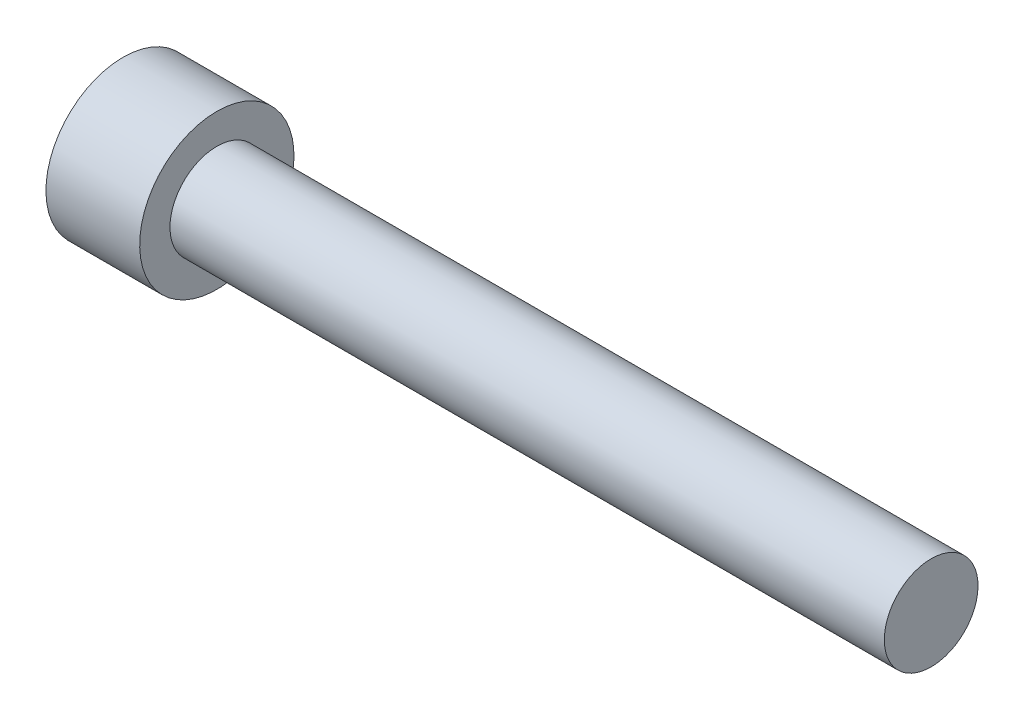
ISO-10303-21;
HEADER;
FILE_DESCRIPTION(('STEP AP214'),'2;1');
FILE_NAME('part.step','',(''),(''),'','','');
FILE_SCHEMA(('AUTOMOTIVE_DESIGN { 1 0 10303 214 1 1 1 1 }'));
ENDSEC;
DATA;
#1=APPLICATION_CONTEXT('core data for automotive mechanical design processes');
#2=APPLICATION_PROTOCOL_DEFINITION('international standard','automotive_design',2000,#1);
#3=PRODUCT_CONTEXT('',#1,'mechanical');
#4=PRODUCT('Part','Part','',(#3));
#5=PRODUCT_RELATED_PRODUCT_CATEGORY('part','',(#4));
#6=PRODUCT_DEFINITION_FORMATION('','',#4);
#7=PRODUCT_DEFINITION_CONTEXT('part definition',#1,'design');
#8=PRODUCT_DEFINITION('design','',#6,#7);
#9=PRODUCT_DEFINITION_SHAPE('','',#8);
#10=(LENGTH_UNIT() NAMED_UNIT(*) SI_UNIT(.MILLI.,.METRE.));
#11=(NAMED_UNIT(*) PLANE_ANGLE_UNIT() SI_UNIT($,.RADIAN.));
#12=(NAMED_UNIT(*) SI_UNIT($,.STERADIAN.) SOLID_ANGLE_UNIT());
#13=UNCERTAINTY_MEASURE_WITH_UNIT(LENGTH_MEASURE(1.E-05),#10,'distance_accuracy_value','');
#14=(GEOMETRIC_REPRESENTATION_CONTEXT(3) GLOBAL_UNCERTAINTY_ASSIGNED_CONTEXT((#13)) GLOBAL_UNIT_ASSIGNED_CONTEXT((#10,
#11,#12)) REPRESENTATION_CONTEXT('',''));
#15=CARTESIAN_POINT('',(0.,0.,0.));
#16=DIRECTION('',(0.,0.,1.));
#17=DIRECTION('',(1.,0.,0.));
#18=AXIS2_PLACEMENT_3D('',#15,#16,#17);
#19=CARTESIAN_POINT('',(35.9156,0.,0.));
#20=DIRECTION('',(1.,0.,0.));
#21=DIRECTION('',(0.,1.,0.));
#22=AXIS2_PLACEMENT_3D('',#19,#20,#21);
#23=PLANE('',#22);
#24=CARTESIAN_POINT('',(35.9156,0.,0.));
#25=DIRECTION('',(1.,0.,0.));
#26=DIRECTION('',(0.,1.,0.));
#27=AXIS2_PLACEMENT_3D('',#24,#25,#26);
#28=CIRCLE('',#27,2.0828);
#29=CARTESIAN_POINT('',(35.9156,2.0828,0.));
#30=VERTEX_POINT('',#29);
#31=EDGE_CURVE('E11',#30,#30,#28,.T.);
#32=ORIENTED_EDGE('',*,*,#31,.T.);
#33=EDGE_LOOP('',(#32));
#34=FACE_BOUND('',#33,.T.);
#35=ADVANCED_FACE('F381',(#34),#23,.T.);
#36=CARTESIAN_POINT('',(35.9156,0.,0.));
#37=DIRECTION('',(1.,0.,0.));
#38=DIRECTION('',(0.,1.,0.));
#39=AXIS2_PLACEMENT_3D('',#36,#37,#38);
#40=CYLINDRICAL_SURFACE('',#39,2.0828);
#41=CARTESIAN_POINT('',(4.1656,0.,0.));
#42=DIRECTION('',(1.,0.,0.));
#43=DIRECTION('',(0.,1.,0.));
#44=AXIS2_PLACEMENT_3D('',#41,#42,#43);
#45=CIRCLE('',#44,2.0828);
#46=CARTESIAN_POINT('',(4.1656,2.0828,0.));
#47=VERTEX_POINT('',#46);
#48=EDGE_CURVE('E388',#47,#47,#45,.T.);
#49=ORIENTED_EDGE('',*,*,#48,.T.);
#50=EDGE_LOOP('',(#49));
#51=FACE_BOUND('',#50,.T.);
#52=ORIENTED_EDGE('',*,*,#31,.F.);
#53=EDGE_LOOP('',(#52));
#54=FACE_BOUND('',#53,.T.);
#55=ADVANCED_FACE('F497',(#51,#54),#40,.T.);
#56=CARTESIAN_POINT('',(4.1656,3.429,0.));
#57=DIRECTION('',(1.,0.,0.));
#58=DIRECTION('',(0.,1.,0.));
#59=AXIS2_PLACEMENT_3D('',#56,#57,#58);
#60=PLANE('',#59);
#61=CARTESIAN_POINT('',(4.1656,0.,0.));
#62=DIRECTION('',(1.,0.,0.));
#63=DIRECTION('',(0.,1.,0.));
#64=AXIS2_PLACEMENT_3D('',#61,#62,#63);
#65=CIRCLE('',#64,3.429);
#66=CARTESIAN_POINT('',(4.1656,3.429,0.));
#67=VERTEX_POINT('',#66);
#68=EDGE_CURVE('E492',#67,#67,#65,.T.);
#69=ORIENTED_EDGE('',*,*,#68,.T.);
#70=EDGE_LOOP('',(#69));
#71=FACE_BOUND('',#70,.T.);
#72=ORIENTED_EDGE('',*,*,#48,.F.);
#73=EDGE_LOOP('',(#72));
#74=FACE_BOUND('',#73,.T.);
#75=ADVANCED_FACE('F500',(#71,#74),#60,.T.);
#76=CARTESIAN_POINT('',(35.9156,0.,0.));
#77=DIRECTION('',(1.,0.,0.));
#78=DIRECTION('',(0.,1.,0.));
#79=AXIS2_PLACEMENT_3D('',#76,#77,#78);
#80=CYLINDRICAL_SURFACE('',#79,3.429);
#81=CARTESIAN_POINT('',(0.,0.,0.));
#82=DIRECTION('',(1.,0.,0.));
#83=DIRECTION('',(0.,1.,0.));
#84=AXIS2_PLACEMENT_3D('',#81,#82,#83);
#85=CIRCLE('',#84,3.429);
#86=CARTESIAN_POINT('',(0.,3.429,0.));
#87=VERTEX_POINT('',#86);
#88=EDGE_CURVE('E483',#87,#87,#85,.T.);
#89=ORIENTED_EDGE('',*,*,#88,.T.);
#90=EDGE_LOOP('',(#89));
#91=FACE_BOUND('',#90,.T.);
#92=ORIENTED_EDGE('',*,*,#68,.F.);
#93=EDGE_LOOP('',(#92));
#94=FACE_BOUND('',#93,.T.);
#95=ADVANCED_FACE('F502',(#91,#94),#80,.T.);
#96=CARTESIAN_POINT('',(0.,0.,0.));
#97=DIRECTION('',(-1.,0.,0.));
#98=DIRECTION('',(0.,-1.,0.));
#99=AXIS2_PLACEMENT_3D('',#96,#97,#98);
#100=PLANE('',#99);
#101=DIRECTION('',(0.,0.866025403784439,0.5));
#102=VECTOR('',#101,1.);
#103=CARTESIAN_POINT('',(0.,-1.7859375,1.03111149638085));
#104=LINE('',#103,#102);
#105=CARTESIAN_POINT('',(0.,-1.7859375,1.03111149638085));
#106=VERTEX_POINT('',#105);
#107=CARTESIAN_POINT('',(0.,0.,2.06222299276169));
#108=VERTEX_POINT('',#107);
#109=EDGE_CURVE('E395',#106,#108,#104,.T.);
#110=ORIENTED_EDGE('',*,*,#109,.F.);
#111=DIRECTION('',(0.,0.,1.));
#112=VECTOR('',#111,1.);
#113=CARTESIAN_POINT('',(0.,-1.7859375,-1.03111149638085));
#114=LINE('',#113,#112);
#115=CARTESIAN_POINT('',(0.,-1.7859375,-1.03111149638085));
#116=VERTEX_POINT('',#115);
#117=EDGE_CURVE('E465',#116,#106,#114,.T.);
#118=ORIENTED_EDGE('',*,*,#117,.F.);
#119=DIRECTION('',(0.,-0.866025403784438,0.5));
#120=VECTOR('',#119,1.);
#121=CARTESIAN_POINT('',(0.,0.,-2.06222299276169));
#122=LINE('',#121,#120);
#123=CARTESIAN_POINT('',(0.,0.,-2.06222299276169));
#124=VERTEX_POINT('',#123);
#125=EDGE_CURVE('E459',#124,#116,#122,.T.);
#126=ORIENTED_EDGE('',*,*,#125,.F.);
#127=DIRECTION('',(0.,-0.866025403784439,-0.499999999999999));
#128=VECTOR('',#127,1.);
#129=CARTESIAN_POINT('',(0.,1.7859375,-1.03111149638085));
#130=LINE('',#129,#128);
#131=CARTESIAN_POINT('',(0.,1.7859375,-1.03111149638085));
#132=VERTEX_POINT('',#131);
#133=EDGE_CURVE('E457',#132,#124,#130,.T.);
#134=ORIENTED_EDGE('',*,*,#133,.F.);
#135=DIRECTION('',(0.,0.,-1.));
#136=VECTOR('',#135,1.);
#137=CARTESIAN_POINT('',(0.,1.7859375,1.03111149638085));
#138=LINE('',#137,#136);
#139=CARTESIAN_POINT('',(0.,1.7859375,1.03111149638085));
#140=VERTEX_POINT('',#139);
#141=EDGE_CURVE('E438',#140,#132,#138,.T.);
#142=ORIENTED_EDGE('',*,*,#141,.F.);
#143=DIRECTION('',(0.,0.866025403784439,-0.5));
#144=VECTOR('',#143,1.);
#145=CARTESIAN_POINT('',(0.,0.,2.06222299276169));
#146=LINE('',#145,#144);
#147=EDGE_CURVE('E449',#108,#140,#146,.T.);
#148=ORIENTED_EDGE('',*,*,#147,.F.);
#149=EDGE_LOOP('',(#110,#118,#126,#134,#142,#148));
#150=FACE_BOUND('',#149,.T.);
#151=ORIENTED_EDGE('',*,*,#88,.F.);
#152=EDGE_LOOP('',(#151));
#153=FACE_BOUND('',#152,.T.);
#154=ADVANCED_FACE('F453',(#150,#153),#100,.T.);
#155=CARTESIAN_POINT('',(4.826,-1.7859375,1.03111149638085));
#156=DIRECTION('',(0.,-0.5,0.866025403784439));
#157=DIRECTION('',(0.,-0.866025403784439,-0.5));
#158=AXIS2_PLACEMENT_3D('',#155,#156,#157);
#159=PLANE('',#158);
#160=ORIENTED_EDGE('',*,*,#109,.T.);
#161=DIRECTION('',(-1.,0.,0.));
#162=VECTOR('',#161,1.);
#163=CARTESIAN_POINT('',(4.826,0.,2.06222299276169));
#164=LINE('',#163,#162);
#165=CARTESIAN_POINT('',(4.826,0.,2.06222299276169));
#166=VERTEX_POINT('',#165);
#167=EDGE_CURVE('E446',#166,#108,#164,.T.);
#168=ORIENTED_EDGE('',*,*,#167,.F.);
#169=DIRECTION('',(0.,0.866025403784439,0.5));
#170=VECTOR('',#169,1.);
#171=CARTESIAN_POINT('',(4.826,-1.7859375,1.03111149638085));
#172=LINE('',#171,#170);
#173=CARTESIAN_POINT('',(4.826,-1.7859375,1.03111149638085));
#174=VERTEX_POINT('',#173);
#175=EDGE_CURVE('E467',#174,#166,#172,.T.);
#176=ORIENTED_EDGE('',*,*,#175,.F.);
#177=DIRECTION('',(-1.,0.,0.));
#178=VECTOR('',#177,1.);
#179=CARTESIAN_POINT('',(4.826,-1.7859375,1.03111149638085));
#180=LINE('',#179,#178);
#181=EDGE_CURVE('E402',#174,#106,#180,.T.);
#182=ORIENTED_EDGE('',*,*,#181,.T.);
#183=EDGE_LOOP('',(#160,#168,#176,#182));
#184=FACE_BOUND('',#183,.T.);
#185=ADVANCED_FACE('F533',(#184),#159,.F.);
#186=CARTESIAN_POINT('',(4.826,-1.7859375,-1.03111149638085));
#187=DIRECTION('',(0.,-1.,0.));
#188=DIRECTION('',(1.,0.,0.));
#189=AXIS2_PLACEMENT_3D('',#186,#187,#188);
#190=PLANE('',#189);
#191=ORIENTED_EDGE('',*,*,#117,.T.);
#192=ORIENTED_EDGE('',*,*,#181,.F.);
#193=DIRECTION('',(0.,0.,1.));
#194=VECTOR('',#193,1.);
#195=CARTESIAN_POINT('',(4.826,-1.7859375,-1.03111149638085));
#196=LINE('',#195,#194);
#197=CARTESIAN_POINT('',(4.826,-1.7859375,-1.03111149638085));
#198=VERTEX_POINT('',#197);
#199=EDGE_CURVE('E479',#198,#174,#196,.T.);
#200=ORIENTED_EDGE('',*,*,#199,.F.);
#201=DIRECTION('',(-1.,0.,0.));
#202=VECTOR('',#201,1.);
#203=CARTESIAN_POINT('',(4.826,-1.7859375,-1.03111149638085));
#204=LINE('',#203,#202);
#205=EDGE_CURVE('E484',#198,#116,#204,.T.);
#206=ORIENTED_EDGE('',*,*,#205,.T.);
#207=EDGE_LOOP('',(#191,#192,#200,#206));
#208=FACE_BOUND('',#207,.T.);
#209=ADVANCED_FACE('F540',(#208),#190,.F.);
#210=CARTESIAN_POINT('',(4.826,0.,-2.06222299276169));
#211=DIRECTION('',(0.,-0.5,-0.866025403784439));
#212=DIRECTION('',(0.,0.866025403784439,-0.5));
#213=AXIS2_PLACEMENT_3D('',#210,#211,#212);
#214=PLANE('',#213);
#215=ORIENTED_EDGE('',*,*,#125,.T.);
#216=ORIENTED_EDGE('',*,*,#205,.F.);
#217=DIRECTION('',(0.,-0.866025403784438,0.5));
#218=VECTOR('',#217,1.);
#219=CARTESIAN_POINT('',(4.826,0.,-2.06222299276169));
#220=LINE('',#219,#218);
#221=CARTESIAN_POINT('',(4.826,0.,-2.06222299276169));
#222=VERTEX_POINT('',#221);
#223=EDGE_CURVE('E476',#222,#198,#220,.T.);
#224=ORIENTED_EDGE('',*,*,#223,.F.);
#225=DIRECTION('',(-1.,0.,0.));
#226=VECTOR('',#225,1.);
#227=CARTESIAN_POINT('',(4.826,0.,-2.06222299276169));
#228=LINE('',#227,#226);
#229=EDGE_CURVE('E486',#222,#124,#228,.T.);
#230=ORIENTED_EDGE('',*,*,#229,.T.);
#231=EDGE_LOOP('',(#215,#216,#224,#230));
#232=FACE_BOUND('',#231,.T.);
#233=ADVANCED_FACE('F547',(#232),#214,.F.);
#234=CARTESIAN_POINT('',(4.826,1.7859375,-1.03111149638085));
#235=DIRECTION('',(0.,0.499999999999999,-0.866025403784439));
#236=DIRECTION('',(0.,0.866025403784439,0.499999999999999));
#237=AXIS2_PLACEMENT_3D('',#234,#235,#236);
#238=PLANE('',#237);
#239=ORIENTED_EDGE('',*,*,#133,.T.);
#240=ORIENTED_EDGE('',*,*,#229,.F.);
#241=DIRECTION('',(0.,-0.866025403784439,-0.499999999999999));
#242=VECTOR('',#241,1.);
#243=CARTESIAN_POINT('',(4.826,1.7859375,-1.03111149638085));
#244=LINE('',#243,#242);
#245=CARTESIAN_POINT('',(4.826,1.7859375,-1.03111149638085));
#246=VERTEX_POINT('',#245);
#247=EDGE_CURVE('E473',#246,#222,#244,.T.);
#248=ORIENTED_EDGE('',*,*,#247,.F.);
#249=DIRECTION('',(-1.,0.,0.));
#250=VECTOR('',#249,1.);
#251=CARTESIAN_POINT('',(4.826,1.7859375,-1.03111149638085));
#252=LINE('',#251,#250);
#253=EDGE_CURVE('E445',#246,#132,#252,.T.);
#254=ORIENTED_EDGE('',*,*,#253,.T.);
#255=EDGE_LOOP('',(#239,#240,#248,#254));
#256=FACE_BOUND('',#255,.T.);
#257=ADVANCED_FACE('F554',(#256),#238,.F.);
#258=CARTESIAN_POINT('',(4.826,1.7859375,1.03111149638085));
#259=DIRECTION('',(0.,1.,0.));
#260=DIRECTION('',(-1.,0.,0.));
#261=AXIS2_PLACEMENT_3D('',#258,#259,#260);
#262=PLANE('',#261);
#263=ORIENTED_EDGE('',*,*,#141,.T.);
#264=ORIENTED_EDGE('',*,*,#253,.F.);
#265=DIRECTION('',(0.,0.,-1.));
#266=VECTOR('',#265,1.);
#267=CARTESIAN_POINT('',(4.826,1.7859375,1.03111149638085));
#268=LINE('',#267,#266);
#269=CARTESIAN_POINT('',(4.826,1.7859375,1.03111149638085));
#270=VERTEX_POINT('',#269);
#271=EDGE_CURVE('E441',#270,#246,#268,.T.);
#272=ORIENTED_EDGE('',*,*,#271,.F.);
#273=DIRECTION('',(-1.,0.,0.));
#274=VECTOR('',#273,1.);
#275=CARTESIAN_POINT('',(4.826,1.7859375,1.03111149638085));
#276=LINE('',#275,#274);
#277=EDGE_CURVE('E434',#270,#140,#276,.T.);
#278=ORIENTED_EDGE('',*,*,#277,.T.);
#279=EDGE_LOOP('',(#263,#264,#272,#278));
#280=FACE_BOUND('',#279,.T.);
#281=ADVANCED_FACE('F436',(#280),#262,.F.);
#282=CARTESIAN_POINT('',(4.826,0.,2.06222299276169));
#283=DIRECTION('',(0.,0.5,0.866025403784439));
#284=DIRECTION('',(0.,-0.866025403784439,0.5));
#285=AXIS2_PLACEMENT_3D('',#282,#283,#284);
#286=PLANE('',#285);
#287=ORIENTED_EDGE('',*,*,#147,.T.);
#288=ORIENTED_EDGE('',*,*,#277,.F.);
#289=DIRECTION('',(0.,0.866025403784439,-0.5));
#290=VECTOR('',#289,1.);
#291=CARTESIAN_POINT('',(4.826,0.,2.06222299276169));
#292=LINE('',#291,#290);
#293=EDGE_CURVE('E470',#166,#270,#292,.T.);
#294=ORIENTED_EDGE('',*,*,#293,.F.);
#295=ORIENTED_EDGE('',*,*,#167,.T.);
#296=EDGE_LOOP('',(#287,#288,#294,#295));
#297=FACE_BOUND('',#296,.T.);
#298=ADVANCED_FACE('F450',(#297),#286,.F.);
#299=CARTESIAN_POINT('',(4.826,1.7859375,3.09333448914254));
#300=DIRECTION('',(-1.,0.,0.));
#301=DIRECTION('',(0.,-1.,0.));
#302=AXIS2_PLACEMENT_3D('',#299,#300,#301);
#303=PLANE('',#302);
#304=ORIENTED_EDGE('',*,*,#175,.T.);
#305=ORIENTED_EDGE('',*,*,#293,.T.);
#306=ORIENTED_EDGE('',*,*,#271,.T.);
#307=ORIENTED_EDGE('',*,*,#247,.T.);
#308=ORIENTED_EDGE('',*,*,#223,.T.);
#309=ORIENTED_EDGE('',*,*,#199,.T.);
#310=EDGE_LOOP('',(#304,#305,#306,#307,#308,#309));
#311=FACE_BOUND('',#310,.T.);
#312=ADVANCED_FACE('F575',(#311),#303,.T.);
#313=CLOSED_SHELL('',(#35,#55,#75,#95,#154,#185,#209,#233,#257,#281,#298,#312));
#314=MANIFOLD_SOLID_BREP('B2',#313);
#315=ADVANCED_BREP_SHAPE_REPRESENTATION('',(#18,#314),#14);
#316=SHAPE_DEFINITION_REPRESENTATION(#9,#315);
ENDSEC;
END-ISO-10303-21;
